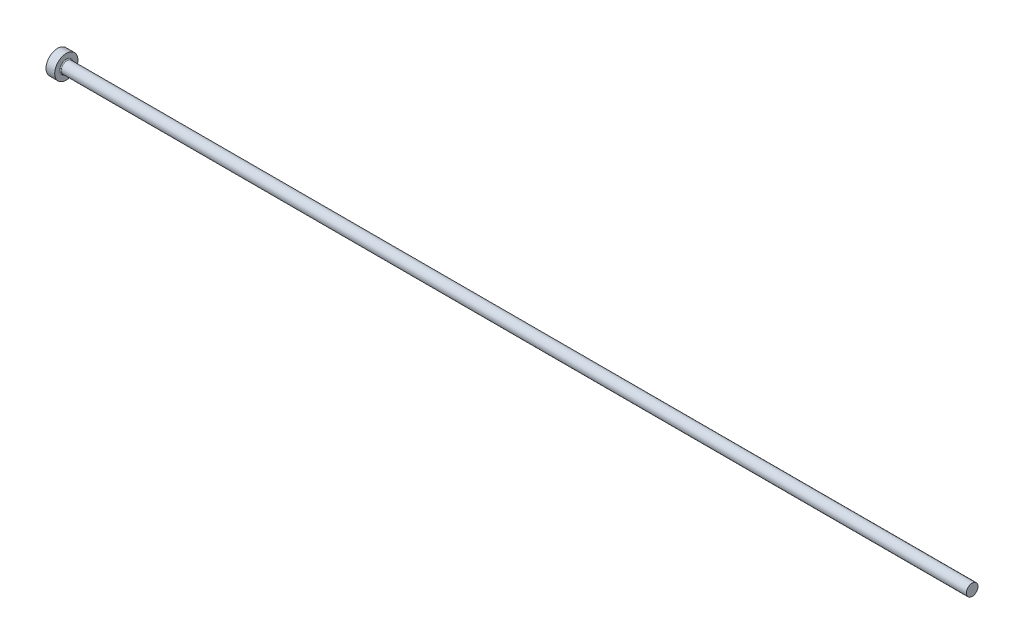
ISO-10303-21;
HEADER;
FILE_DESCRIPTION(('STEP AP214'),'2;1');
FILE_NAME('part.step','',(''),(''),'','','');
FILE_SCHEMA(('AUTOMOTIVE_DESIGN { 1 0 10303 214 1 1 1 1 }'));
ENDSEC;
DATA;
#1=APPLICATION_CONTEXT('core data for automotive mechanical design processes');
#2=APPLICATION_PROTOCOL_DEFINITION('international standard','automotive_design',2000,#1);
#3=PRODUCT_CONTEXT('',#1,'mechanical');
#4=PRODUCT('Part','Part','',(#3));
#5=PRODUCT_RELATED_PRODUCT_CATEGORY('part','',(#4));
#6=PRODUCT_DEFINITION_FORMATION('','',#4);
#7=PRODUCT_DEFINITION_CONTEXT('part definition',#1,'design');
#8=PRODUCT_DEFINITION('design','',#6,#7);
#9=PRODUCT_DEFINITION_SHAPE('','',#8);
#10=(LENGTH_UNIT() NAMED_UNIT(*) SI_UNIT(.MILLI.,.METRE.));
#11=(NAMED_UNIT(*) PLANE_ANGLE_UNIT() SI_UNIT($,.RADIAN.));
#12=(NAMED_UNIT(*) SI_UNIT($,.STERADIAN.) SOLID_ANGLE_UNIT());
#13=UNCERTAINTY_MEASURE_WITH_UNIT(LENGTH_MEASURE(1.E-05),#10,'distance_accuracy_value','');
#14=(GEOMETRIC_REPRESENTATION_CONTEXT(3) GLOBAL_UNCERTAINTY_ASSIGNED_CONTEXT((#13)) GLOBAL_UNIT_ASSIGNED_CONTEXT((#10,
#11,#12)) REPRESENTATION_CONTEXT('',''));
#15=CARTESIAN_POINT('',(0.,0.,0.));
#16=DIRECTION('',(0.,0.,1.));
#17=DIRECTION('',(1.,0.,0.));
#18=AXIS2_PLACEMENT_3D('',#15,#16,#17);
#19=CARTESIAN_POINT('',(0.,0.,0.));
#20=DIRECTION('',(-1.,0.,0.));
#21=DIRECTION('',(0.,-1.,0.));
#22=AXIS2_PLACEMENT_3D('',#19,#20,#21);
#23=PLANE('',#22);
#24=CARTESIAN_POINT('',(0.,0.,0.));
#25=DIRECTION('',(1.,0.,0.));
#26=DIRECTION('',(0.,1.,0.));
#27=AXIS2_PLACEMENT_3D('',#24,#25,#26);
#28=CIRCLE('',#27,4.);
#29=CARTESIAN_POINT('',(0.,4.,0.));
#30=VERTEX_POINT('',#29);
#31=EDGE_CURVE('E25',#30,#30,#28,.T.);
#32=ORIENTED_EDGE('',*,*,#31,.F.);
#33=EDGE_LOOP('',(#32));
#34=FACE_BOUND('',#33,.T.);
#35=ADVANCED_FACE('F14',(#34),#23,.T.);
#36=CARTESIAN_POINT('',(315.,0.,0.));
#37=DIRECTION('',(1.,0.,0.));
#38=DIRECTION('',(0.,1.,0.));
#39=AXIS2_PLACEMENT_3D('',#36,#37,#38);
#40=CYLINDRICAL_SURFACE('',#39,4.);
#41=ORIENTED_EDGE('',*,*,#31,.T.);
#42=EDGE_LOOP('',(#41));
#43=FACE_BOUND('',#42,.T.);
#44=CARTESIAN_POINT('',(3.,0.,0.));
#45=DIRECTION('',(1.,0.,0.));
#46=DIRECTION('',(0.,1.,0.));
#47=AXIS2_PLACEMENT_3D('',#44,#45,#46);
#48=CIRCLE('',#47,4.);
#49=CARTESIAN_POINT('',(3.,4.,0.));
#50=VERTEX_POINT('',#49);
#51=EDGE_CURVE('E29',#50,#50,#48,.T.);
#52=ORIENTED_EDGE('',*,*,#51,.F.);
#53=EDGE_LOOP('',(#52));
#54=FACE_BOUND('',#53,.T.);
#55=ADVANCED_FACE('F51',(#43,#54),#40,.T.);
#56=CARTESIAN_POINT('',(3.,4.,0.));
#57=DIRECTION('',(1.,0.,0.));
#58=DIRECTION('',(0.,1.,0.));
#59=AXIS2_PLACEMENT_3D('',#56,#57,#58);
#60=PLANE('',#59);
#61=CARTESIAN_POINT('',(3.,0.,0.));
#62=DIRECTION('',(1.,0.,0.));
#63=DIRECTION('',(0.,1.,0.));
#64=AXIS2_PLACEMENT_3D('',#61,#62,#63);
#65=CIRCLE('',#64,2.29999999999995);
#66=CARTESIAN_POINT('',(3.,2.29999999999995,0.));
#67=VERTEX_POINT('',#66);
#68=EDGE_CURVE('E9',#67,#67,#65,.F.);
#69=ORIENTED_EDGE('',*,*,#68,.T.);
#70=EDGE_LOOP('',(#69));
#71=FACE_BOUND('',#70,.T.);
#72=ORIENTED_EDGE('',*,*,#51,.T.);
#73=EDGE_LOOP('',(#72));
#74=FACE_BOUND('',#73,.T.);
#75=ADVANCED_FACE('F42',(#71,#74),#60,.T.);
#76=CARTESIAN_POINT('',(315.,0.,0.));
#77=DIRECTION('',(1.,0.,0.));
#78=DIRECTION('',(0.,1.,0.));
#79=AXIS2_PLACEMENT_3D('',#76,#77,#78);
#80=CYLINDRICAL_SURFACE('',#79,1.99999999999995);
#81=CARTESIAN_POINT('',(3.3,0.,0.));
#82=DIRECTION('',(1.,0.,0.));
#83=DIRECTION('',(0.,1.,0.));
#84=AXIS2_PLACEMENT_3D('',#81,#82,#83);
#85=CIRCLE('',#84,1.99999999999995);
#86=CARTESIAN_POINT('',(3.3,1.99999999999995,0.));
#87=VERTEX_POINT('',#86);
#88=EDGE_CURVE('E21',#87,#87,#85,.T.);
#89=ORIENTED_EDGE('',*,*,#88,.T.);
#90=EDGE_LOOP('',(#89));
#91=FACE_BOUND('',#90,.T.);
#92=CARTESIAN_POINT('',(315.,0.,0.));
#93=DIRECTION('',(1.,0.,0.));
#94=DIRECTION('',(0.,1.,0.));
#95=AXIS2_PLACEMENT_3D('',#92,#93,#94);
#96=CIRCLE('',#95,1.99999999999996);
#97=CARTESIAN_POINT('',(315.,1.99999999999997,0.));
#98=VERTEX_POINT('',#97);
#99=EDGE_CURVE('E34',#98,#98,#96,.T.);
#100=ORIENTED_EDGE('',*,*,#99,.F.);
#101=EDGE_LOOP('',(#100));
#102=FACE_BOUND('',#101,.T.);
#103=ADVANCED_FACE('F40',(#91,#102),#80,.T.);
#104=CARTESIAN_POINT('',(315.,1.99999999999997,0.));
#105=DIRECTION('',(1.,0.,0.));
#106=DIRECTION('',(0.,1.,0.));
#107=AXIS2_PLACEMENT_3D('',#104,#105,#106);
#108=PLANE('',#107);
#109=ORIENTED_EDGE('',*,*,#99,.T.);
#110=EDGE_LOOP('',(#109));
#111=FACE_BOUND('',#110,.T.);
#112=ADVANCED_FACE('F38',(#111),#108,.T.);
#113=CARTESIAN_POINT('',(3.3,0.,0.));
#114=DIRECTION('',(1.,0.,0.));
#115=DIRECTION('',(0.,1.,0.));
#116=AXIS2_PLACEMENT_3D('',#113,#114,#115);
#117=TOROIDAL_SURFACE('',#116,2.29999999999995,0.3);
#118=ORIENTED_EDGE('',*,*,#68,.F.);
#119=EDGE_LOOP('',(#118));
#120=FACE_BOUND('',#119,.T.);
#121=ORIENTED_EDGE('',*,*,#88,.F.);
#122=EDGE_LOOP('',(#121));
#123=FACE_BOUND('',#122,.T.);
#124=ADVANCED_FACE('F16',(#120,#123),#117,.F.);
#125=CLOSED_SHELL('',(#35,#55,#75,#103,#112,#124));
#126=MANIFOLD_SOLID_BREP('B1',#125);
#127=ADVANCED_BREP_SHAPE_REPRESENTATION('',(#18,#126),#14);
#128=SHAPE_DEFINITION_REPRESENTATION(#9,#127);
ENDSEC;
END-ISO-10303-21;
